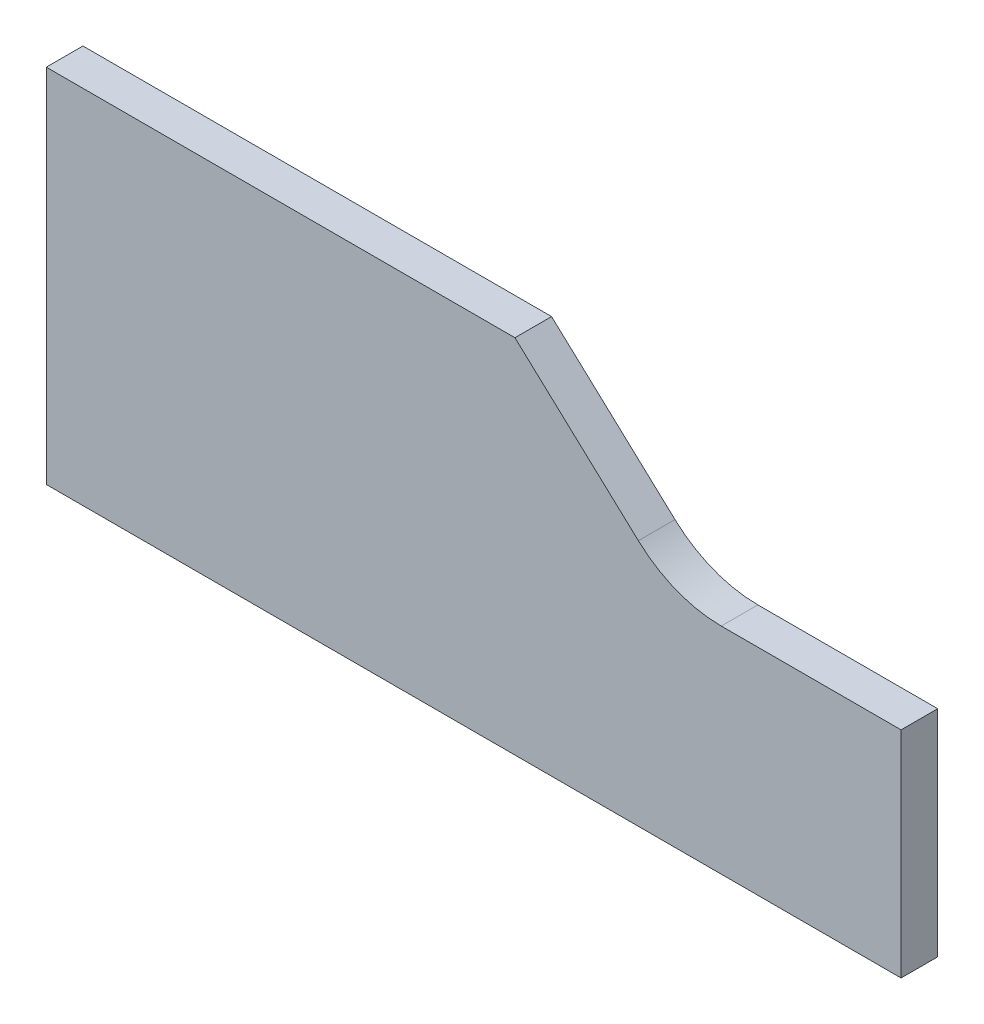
ISO-10303-21;
HEADER;
FILE_DESCRIPTION(('STEP AP214'),'2;1');
FILE_NAME('part.step','',(''),(''),'','','');
FILE_SCHEMA(('AUTOMOTIVE_DESIGN { 1 0 10303 214 1 1 1 1 }'));
ENDSEC;
DATA;
#1=APPLICATION_CONTEXT('core data for automotive mechanical design processes');
#2=APPLICATION_PROTOCOL_DEFINITION('international standard','automotive_design',2000,#1);
#3=PRODUCT_CONTEXT('',#1,'mechanical');
#4=PRODUCT('Part','Part','',(#3));
#5=PRODUCT_RELATED_PRODUCT_CATEGORY('part','',(#4));
#6=PRODUCT_DEFINITION_FORMATION('','',#4);
#7=PRODUCT_DEFINITION_CONTEXT('part definition',#1,'design');
#8=PRODUCT_DEFINITION('design','',#6,#7);
#9=PRODUCT_DEFINITION_SHAPE('','',#8);
#10=(LENGTH_UNIT() NAMED_UNIT(*) SI_UNIT(.MILLI.,.METRE.));
#11=(NAMED_UNIT(*) PLANE_ANGLE_UNIT() SI_UNIT($,.RADIAN.));
#12=(NAMED_UNIT(*) SI_UNIT($,.STERADIAN.) SOLID_ANGLE_UNIT());
#13=UNCERTAINTY_MEASURE_WITH_UNIT(LENGTH_MEASURE(1.E-05),#10,'distance_accuracy_value','');
#14=(GEOMETRIC_REPRESENTATION_CONTEXT(3) GLOBAL_UNCERTAINTY_ASSIGNED_CONTEXT((#13)) GLOBAL_UNIT_ASSIGNED_CONTEXT((#10,
#11,#12)) REPRESENTATION_CONTEXT('',''));
#15=CARTESIAN_POINT('',(0.,0.,0.));
#16=DIRECTION('',(0.,0.,1.));
#17=DIRECTION('',(1.,0.,0.));
#18=AXIS2_PLACEMENT_3D('',#15,#16,#17);
#19=CARTESIAN_POINT('',(70.,0.,1.5));
#20=DIRECTION('',(0.,1.,0.));
#21=DIRECTION('',(-1.,0.,0.));
#22=AXIS2_PLACEMENT_3D('',#19,#20,#21);
#23=PLANE('',#22);
#24=DIRECTION('',(1.,0.,0.));
#25=VECTOR('',#24,1.);
#26=CARTESIAN_POINT('',(70.,0.,-1.5));
#27=LINE('',#26,#25);
#28=CARTESIAN_POINT('',(0.,0.,-1.5));
#29=VERTEX_POINT('',#28);
#30=CARTESIAN_POINT('',(70.,0.,-1.5));
#31=VERTEX_POINT('',#30);
#32=EDGE_CURVE('E114',#29,#31,#27,.T.);
#33=ORIENTED_EDGE('',*,*,#32,.T.);
#34=DIRECTION('',(0.,0.,-1.));
#35=VECTOR('',#34,1.);
#36=CARTESIAN_POINT('',(70.,0.,1.5));
#37=LINE('',#36,#35);
#38=CARTESIAN_POINT('',(70.,0.,1.5));
#39=VERTEX_POINT('',#38);
#40=EDGE_CURVE('E96',#39,#31,#37,.T.);
#41=ORIENTED_EDGE('',*,*,#40,.F.);
#42=DIRECTION('',(1.,0.,0.));
#43=VECTOR('',#42,1.);
#44=CARTESIAN_POINT('',(70.,0.,1.5));
#45=LINE('',#44,#43);
#46=CARTESIAN_POINT('',(0.,0.,1.5));
#47=VERTEX_POINT('',#46);
#48=EDGE_CURVE('E102',#47,#39,#45,.T.);
#49=ORIENTED_EDGE('',*,*,#48,.F.);
#50=DIRECTION('',(0.,0.,-1.));
#51=VECTOR('',#50,1.);
#52=CARTESIAN_POINT('',(0.,0.,1.5));
#53=LINE('',#52,#51);
#54=EDGE_CURVE('E128',#47,#29,#53,.T.);
#55=ORIENTED_EDGE('',*,*,#54,.T.);
#56=EDGE_LOOP('',(#33,#41,#49,#55));
#57=FACE_BOUND('',#56,.T.);
#58=ADVANCED_FACE('F33',(#57),#23,.F.);
#59=CARTESIAN_POINT('',(70.,17.5988848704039,1.5));
#60=DIRECTION('',(-1.,0.,0.));
#61=DIRECTION('',(0.,0.,1.));
#62=AXIS2_PLACEMENT_3D('',#59,#60,#61);
#63=PLANE('',#62);
#64=DIRECTION('',(0.,1.,0.));
#65=VECTOR('',#64,1.);
#66=CARTESIAN_POINT('',(70.,17.5988848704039,-1.5));
#67=LINE('',#66,#65);
#68=CARTESIAN_POINT('',(70.,17.5988848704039,-1.5));
#69=VERTEX_POINT('',#68);
#70=EDGE_CURVE('E137',#31,#69,#67,.T.);
#71=ORIENTED_EDGE('',*,*,#70,.T.);
#72=DIRECTION('',(0.,0.,-1.));
#73=VECTOR('',#72,1.);
#74=CARTESIAN_POINT('',(70.,17.5988848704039,1.5));
#75=LINE('',#74,#73);
#76=CARTESIAN_POINT('',(70.,17.5988848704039,1.5));
#77=VERTEX_POINT('',#76);
#78=EDGE_CURVE('E99',#77,#69,#75,.T.);
#79=ORIENTED_EDGE('',*,*,#78,.F.);
#80=DIRECTION('',(0.,1.,0.));
#81=VECTOR('',#80,1.);
#82=CARTESIAN_POINT('',(70.,17.5988848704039,1.5));
#83=LINE('',#82,#81);
#84=EDGE_CURVE('E92',#39,#77,#83,.T.);
#85=ORIENTED_EDGE('',*,*,#84,.F.);
#86=ORIENTED_EDGE('',*,*,#40,.T.);
#87=EDGE_LOOP('',(#71,#79,#85,#86));
#88=FACE_BOUND('',#87,.T.);
#89=ADVANCED_FACE('F94',(#88),#63,.F.);
#90=CARTESIAN_POINT('',(51.3614504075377,17.5988848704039,1.5));
#91=DIRECTION('',(0.,-1.,0.));
#92=DIRECTION('',(0.,0.,-1.));
#93=AXIS2_PLACEMENT_3D('',#90,#91,#92);
#94=PLANE('',#93);
#95=DIRECTION('',(-1.,0.,0.));
#96=VECTOR('',#95,1.);
#97=CARTESIAN_POINT('',(51.3614504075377,17.5988848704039,-1.5));
#98=LINE('',#97,#96);
#99=CARTESIAN_POINT('',(55.2752775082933,17.5988848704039,-1.5));
#100=VERTEX_POINT('',#99);
#101=EDGE_CURVE('E135',#69,#100,#98,.T.);
#102=ORIENTED_EDGE('',*,*,#101,.T.);
#103=DIRECTION('',(0.,0.,-1.));
#104=VECTOR('',#103,1.);
#105=CARTESIAN_POINT('',(55.2752775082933,17.5988848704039,1.5));
#106=LINE('',#105,#104);
#107=CARTESIAN_POINT('',(55.2752775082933,17.5988848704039,1.5));
#108=VERTEX_POINT('',#107);
#109=EDGE_CURVE('E48',#100,#108,#106,.F.);
#110=ORIENTED_EDGE('',*,*,#109,.T.);
#111=DIRECTION('',(-1.,0.,0.));
#112=VECTOR('',#111,1.);
#113=CARTESIAN_POINT('',(51.3614504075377,17.5988848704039,1.5));
#114=LINE('',#113,#112);
#115=EDGE_CURVE('E101',#77,#108,#114,.T.);
#116=ORIENTED_EDGE('',*,*,#115,.F.);
#117=ORIENTED_EDGE('',*,*,#78,.T.);
#118=EDGE_LOOP('',(#102,#110,#116,#117));
#119=FACE_BOUND('',#118,.T.);
#120=ADVANCED_FACE('F161',(#119),#94,.F.);
#121=CARTESIAN_POINT('',(38.3794833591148,29.5988848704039,1.5));
#122=DIRECTION('',(-0.678788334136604,-0.734333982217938,0.));
#123=DIRECTION('',(0.734333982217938,-0.678788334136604,0.));
#124=AXIS2_PLACEMENT_3D('',#121,#122,#123);
#125=PLANE('',#124);
#126=DIRECTION('',(-0.734333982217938,0.678788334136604,0.));
#127=VECTOR('',#126,1.);
#128=CARTESIAN_POINT('',(38.3794833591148,29.5988848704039,1.5));
#129=LINE('',#128,#127);
#130=CARTESIAN_POINT('',(48.4873941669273,20.2555450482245,1.5));
#131=VERTEX_POINT('',#130);
#132=CARTESIAN_POINT('',(38.3794833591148,29.5988848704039,1.5));
#133=VERTEX_POINT('',#132);
#134=EDGE_CURVE('E143',#131,#133,#129,.T.);
#135=ORIENTED_EDGE('',*,*,#134,.F.);
#136=DIRECTION('',(0.,0.,-1.));
#137=VECTOR('',#136,1.);
#138=CARTESIAN_POINT('',(48.4873941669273,20.2555450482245,-1.5));
#139=LINE('',#138,#137);
#140=CARTESIAN_POINT('',(48.4873941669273,20.2555450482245,-1.5));
#141=VERTEX_POINT('',#140);
#142=EDGE_CURVE('E115',#131,#141,#139,.T.);
#143=ORIENTED_EDGE('',*,*,#142,.T.);
#144=DIRECTION('',(-0.734333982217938,0.678788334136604,0.));
#145=VECTOR('',#144,1.);
#146=CARTESIAN_POINT('',(38.3794833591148,29.5988848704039,-1.5));
#147=LINE('',#146,#145);
#148=CARTESIAN_POINT('',(38.3794833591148,29.5988848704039,-1.5));
#149=VERTEX_POINT('',#148);
#150=EDGE_CURVE('E133',#141,#149,#147,.T.);
#151=ORIENTED_EDGE('',*,*,#150,.T.);
#152=DIRECTION('',(0.,0.,-1.));
#153=VECTOR('',#152,1.);
#154=CARTESIAN_POINT('',(38.3794833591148,29.5988848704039,1.5));
#155=LINE('',#154,#153);
#156=EDGE_CURVE('E119',#133,#149,#155,.T.);
#157=ORIENTED_EDGE('',*,*,#156,.F.);
#158=EDGE_LOOP('',(#135,#143,#151,#157));
#159=FACE_BOUND('',#158,.T.);
#160=ADVANCED_FACE('F150',(#159),#125,.F.);
#161=CARTESIAN_POINT('',(0.,29.5988848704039,1.5));
#162=DIRECTION('',(0.,-1.,0.));
#163=DIRECTION('',(0.,0.,-1.));
#164=AXIS2_PLACEMENT_3D('',#161,#162,#163);
#165=PLANE('',#164);
#166=DIRECTION('',(-1.,0.,0.));
#167=VECTOR('',#166,1.);
#168=CARTESIAN_POINT('',(0.,29.5988848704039,-1.5));
#169=LINE('',#168,#167);
#170=CARTESIAN_POINT('',(0.,29.5988848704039,-1.5));
#171=VERTEX_POINT('',#170);
#172=EDGE_CURVE('E131',#149,#171,#169,.T.);
#173=ORIENTED_EDGE('',*,*,#172,.T.);
#174=DIRECTION('',(0.,0.,-1.));
#175=VECTOR('',#174,1.);
#176=CARTESIAN_POINT('',(0.,29.5988848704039,1.5));
#177=LINE('',#176,#175);
#178=CARTESIAN_POINT('',(0.,29.5988848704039,1.5));
#179=VERTEX_POINT('',#178);
#180=EDGE_CURVE('E125',#179,#171,#177,.T.);
#181=ORIENTED_EDGE('',*,*,#180,.F.);
#182=DIRECTION('',(-1.,0.,0.));
#183=VECTOR('',#182,1.);
#184=CARTESIAN_POINT('',(0.,29.5988848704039,1.5));
#185=LINE('',#184,#183);
#186=EDGE_CURVE('E141',#133,#179,#185,.T.);
#187=ORIENTED_EDGE('',*,*,#186,.F.);
#188=ORIENTED_EDGE('',*,*,#156,.T.);
#189=EDGE_LOOP('',(#173,#181,#187,#188));
#190=FACE_BOUND('',#189,.T.);
#191=ADVANCED_FACE('F157',(#190),#165,.F.);
#192=CARTESIAN_POINT('',(0.,0.,1.5));
#193=DIRECTION('',(1.,0.,0.));
#194=DIRECTION('',(0.,0.,-1.));
#195=AXIS2_PLACEMENT_3D('',#192,#193,#194);
#196=PLANE('',#195);
#197=DIRECTION('',(0.,-1.,0.));
#198=VECTOR('',#197,1.);
#199=CARTESIAN_POINT('',(0.,0.,-1.5));
#200=LINE('',#199,#198);
#201=EDGE_CURVE('E111',#171,#29,#200,.T.);
#202=ORIENTED_EDGE('',*,*,#201,.T.);
#203=ORIENTED_EDGE('',*,*,#54,.F.);
#204=DIRECTION('',(0.,-1.,0.));
#205=VECTOR('',#204,1.);
#206=CARTESIAN_POINT('',(0.,0.,1.5));
#207=LINE('',#206,#205);
#208=EDGE_CURVE('E107',#179,#47,#207,.T.);
#209=ORIENTED_EDGE('',*,*,#208,.F.);
#210=ORIENTED_EDGE('',*,*,#180,.T.);
#211=EDGE_LOOP('',(#202,#203,#209,#210));
#212=FACE_BOUND('',#211,.T.);
#213=ADVANCED_FACE('F160',(#212),#196,.F.);
#214=CARTESIAN_POINT('',(0.,0.,1.5));
#215=DIRECTION('',(0.,0.,-1.));
#216=DIRECTION('',(-1.,0.,0.));
#217=AXIS2_PLACEMENT_3D('',#214,#215,#216);
#218=PLANE('',#217);
#219=ORIENTED_EDGE('',*,*,#48,.T.);
#220=ORIENTED_EDGE('',*,*,#84,.T.);
#221=ORIENTED_EDGE('',*,*,#115,.T.);
#222=CARTESIAN_POINT('',(55.2752775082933,27.5988848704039,1.5));
#223=DIRECTION('',(0.,0.,-1.));
#224=DIRECTION('',(-1.,0.,0.));
#225=AXIS2_PLACEMENT_3D('',#222,#223,#224);
#226=CIRCLE('',#225,10.);
#227=EDGE_CURVE('E11',#108,#131,#226,.T.);
#228=ORIENTED_EDGE('',*,*,#227,.T.);
#229=ORIENTED_EDGE('',*,*,#134,.T.);
#230=ORIENTED_EDGE('',*,*,#186,.T.);
#231=ORIENTED_EDGE('',*,*,#208,.T.);
#232=EDGE_LOOP('',(#219,#220,#221,#228,#229,#230,#231));
#233=FACE_BOUND('',#232,.T.);
#234=ADVANCED_FACE('F105',(#233),#218,.F.);
#235=CARTESIAN_POINT('',(0.,0.,-1.5));
#236=DIRECTION('',(0.,0.,-1.));
#237=DIRECTION('',(-1.,0.,0.));
#238=AXIS2_PLACEMENT_3D('',#235,#236,#237);
#239=PLANE('',#238);
#240=ORIENTED_EDGE('',*,*,#32,.F.);
#241=ORIENTED_EDGE('',*,*,#201,.F.);
#242=ORIENTED_EDGE('',*,*,#172,.F.);
#243=ORIENTED_EDGE('',*,*,#150,.F.);
#244=CARTESIAN_POINT('',(55.2752775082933,27.5988848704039,-1.5));
#245=DIRECTION('',(0.,0.,-1.));
#246=DIRECTION('',(-1.,0.,0.));
#247=AXIS2_PLACEMENT_3D('',#244,#245,#246);
#248=CIRCLE('',#247,10.);
#249=EDGE_CURVE('E41',#141,#100,#248,.F.);
#250=ORIENTED_EDGE('',*,*,#249,.T.);
#251=ORIENTED_EDGE('',*,*,#101,.F.);
#252=ORIENTED_EDGE('',*,*,#70,.F.);
#253=EDGE_LOOP('',(#240,#241,#242,#243,#250,#251,#252));
#254=FACE_BOUND('',#253,.T.);
#255=ADVANCED_FACE('F153',(#254),#239,.T.);
#256=CARTESIAN_POINT('',(55.2752775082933,27.5988848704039,1.5));
#257=DIRECTION('',(0.,0.,1.));
#258=DIRECTION('',(1.,0.,0.));
#259=AXIS2_PLACEMENT_3D('',#256,#257,#258);
#260=CYLINDRICAL_SURFACE('',#259,10.);
#261=ORIENTED_EDGE('',*,*,#227,.F.);
#262=ORIENTED_EDGE('',*,*,#109,.F.);
#263=ORIENTED_EDGE('',*,*,#249,.F.);
#264=ORIENTED_EDGE('',*,*,#142,.F.);
#265=EDGE_LOOP('',(#261,#262,#263,#264));
#266=FACE_BOUND('',#265,.T.);
#267=ADVANCED_FACE('F35',(#266),#260,.F.);
#268=CLOSED_SHELL('',(#58,#89,#120,#160,#191,#213,#234,#255,#267));
#269=MANIFOLD_SOLID_BREP('B2',#268);
#270=ADVANCED_BREP_SHAPE_REPRESENTATION('',(#18,#269),#14);
#271=SHAPE_DEFINITION_REPRESENTATION(#9,#270);
ENDSEC;
END-ISO-10303-21;
